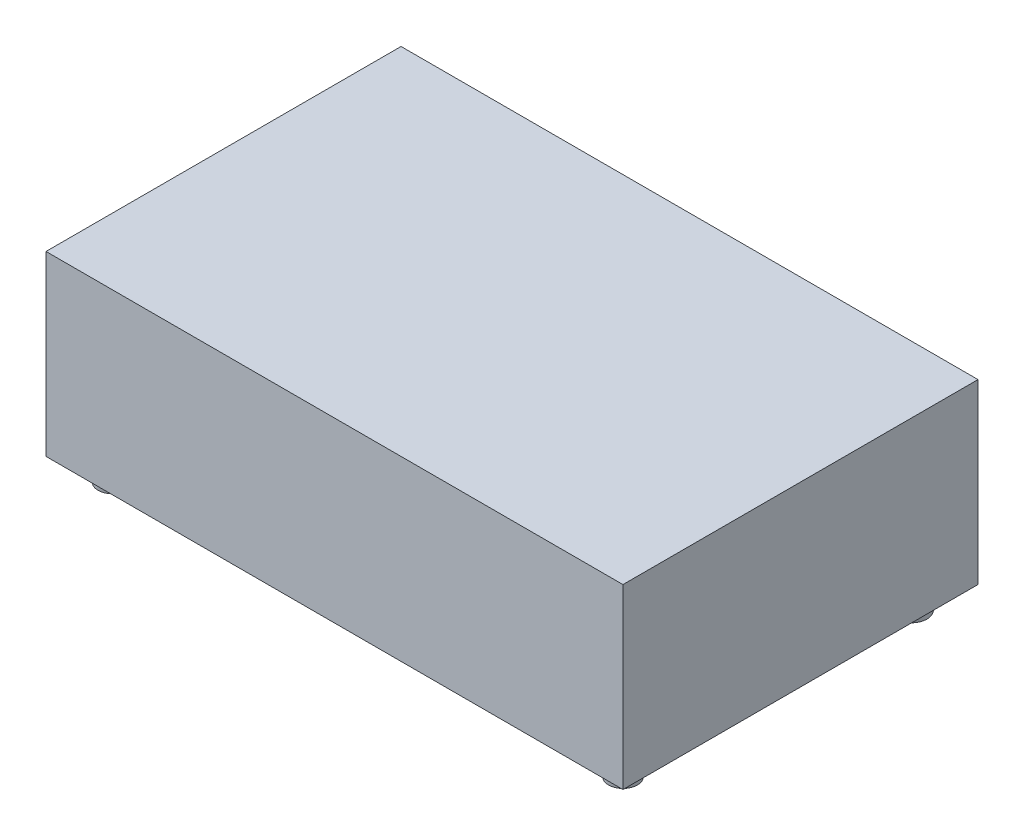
ISO-10303-21;
HEADER;
FILE_DESCRIPTION(('STEP AP214'),'2;1');
FILE_NAME('part.step','',(''),(''),'','','');
FILE_SCHEMA(('AUTOMOTIVE_DESIGN { 1 0 10303 214 1 1 1 1 }'));
ENDSEC;
DATA;
#1=APPLICATION_CONTEXT('core data for automotive mechanical design processes');
#2=APPLICATION_PROTOCOL_DEFINITION('international standard','automotive_design',2000,#1);
#3=PRODUCT_CONTEXT('',#1,'mechanical');
#4=PRODUCT('Part','Part','',(#3));
#5=PRODUCT_RELATED_PRODUCT_CATEGORY('part','',(#4));
#6=PRODUCT_DEFINITION_FORMATION('','',#4);
#7=PRODUCT_DEFINITION_CONTEXT('part definition',#1,'design');
#8=PRODUCT_DEFINITION('design','',#6,#7);
#9=PRODUCT_DEFINITION_SHAPE('','',#8);
#10=(LENGTH_UNIT() NAMED_UNIT(*) SI_UNIT(.MILLI.,.METRE.));
#11=(NAMED_UNIT(*) PLANE_ANGLE_UNIT() SI_UNIT($,.RADIAN.));
#12=(NAMED_UNIT(*) SI_UNIT($,.STERADIAN.) SOLID_ANGLE_UNIT());
#13=UNCERTAINTY_MEASURE_WITH_UNIT(LENGTH_MEASURE(1.E-05),#10,'distance_accuracy_value','');
#14=(GEOMETRIC_REPRESENTATION_CONTEXT(3) GLOBAL_UNCERTAINTY_ASSIGNED_CONTEXT((#13)) GLOBAL_UNIT_ASSIGNED_CONTEXT((#10,
#11,#12)) REPRESENTATION_CONTEXT('',''));
#15=CARTESIAN_POINT('',(0.,0.,0.));
#16=DIRECTION('',(0.,0.,1.));
#17=DIRECTION('',(1.,0.,0.));
#18=AXIS2_PLACEMENT_3D('',#15,#16,#17);
#19=CARTESIAN_POINT('',(0.,-80.,160.));
#20=DIRECTION('',(0.,1.,0.));
#21=DIRECTION('',(0.,0.,1.));
#22=AXIS2_PLACEMENT_3D('',#19,#20,#21);
#23=PLANE('',#22);
#24=CARTESIAN_POINT('',(15.,-80.,15.));
#25=DIRECTION('',(0.,1.,0.));
#26=DIRECTION('',(0.,0.,1.));
#27=AXIS2_PLACEMENT_3D('',#24,#25,#26);
#28=CIRCLE('',#27,8.);
#29=CARTESIAN_POINT('',(15.,-80.,23.));
#30=VERTEX_POINT('',#29);
#31=EDGE_CURVE('E116',#30,#30,#28,.F.);
#32=ORIENTED_EDGE('',*,*,#31,.F.);
#33=EDGE_LOOP('',(#32));
#34=FACE_BOUND('',#33,.T.);
#35=CARTESIAN_POINT('',(15.,-80.,145.));
#36=DIRECTION('',(0.,1.,0.));
#37=DIRECTION('',(0.,0.,1.));
#38=AXIS2_PLACEMENT_3D('',#35,#36,#37);
#39=CIRCLE('',#38,7.5);
#40=CARTESIAN_POINT('',(15.,-80.,152.5));
#41=VERTEX_POINT('',#40);
#42=EDGE_CURVE('E110',#41,#41,#39,.F.);
#43=ORIENTED_EDGE('',*,*,#42,.F.);
#44=EDGE_LOOP('',(#43));
#45=FACE_BOUND('',#44,.T.);
#46=DIRECTION('',(1.,0.,0.));
#47=VECTOR('',#46,1.);
#48=CARTESIAN_POINT('',(0.,-80.,0.));
#49=LINE('',#48,#47);
#50=CARTESIAN_POINT('',(0.,-80.,0.));
#51=VERTEX_POINT('',#50);
#52=CARTESIAN_POINT('',(260.,-80.,0.));
#53=VERTEX_POINT('',#52);
#54=EDGE_CURVE('E91',#51,#53,#49,.T.);
#55=ORIENTED_EDGE('',*,*,#54,.T.);
#56=DIRECTION('',(0.,0.,-1.));
#57=VECTOR('',#56,1.);
#58=CARTESIAN_POINT('',(260.,-80.,160.));
#59=LINE('',#58,#57);
#60=CARTESIAN_POINT('',(260.,-80.,160.));
#61=VERTEX_POINT('',#60);
#62=EDGE_CURVE('E89',#61,#53,#59,.T.);
#63=ORIENTED_EDGE('',*,*,#62,.F.);
#64=DIRECTION('',(1.,0.,0.));
#65=VECTOR('',#64,1.);
#66=CARTESIAN_POINT('',(0.,-80.,160.));
#67=LINE('',#66,#65);
#68=CARTESIAN_POINT('',(0.,-80.,160.));
#69=VERTEX_POINT('',#68);
#70=EDGE_CURVE('E81',#69,#61,#67,.T.);
#71=ORIENTED_EDGE('',*,*,#70,.F.);
#72=DIRECTION('',(0.,0.,-1.));
#73=VECTOR('',#72,1.);
#74=CARTESIAN_POINT('',(0.,-80.,160.));
#75=LINE('',#74,#73);
#76=EDGE_CURVE('E92',#69,#51,#75,.T.);
#77=ORIENTED_EDGE('',*,*,#76,.T.);
#78=EDGE_LOOP('',(#55,#63,#71,#77));
#79=FACE_BOUND('',#78,.T.);
#80=CARTESIAN_POINT('',(245.,-80.,145.));
#81=DIRECTION('',(0.,1.,0.));
#82=DIRECTION('',(0.,0.,1.));
#83=AXIS2_PLACEMENT_3D('',#80,#81,#82);
#84=CIRCLE('',#83,7.50000000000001);
#85=CARTESIAN_POINT('',(245.,-80.,152.5));
#86=VERTEX_POINT('',#85);
#87=EDGE_CURVE('E113',#86,#86,#84,.F.);
#88=ORIENTED_EDGE('',*,*,#87,.F.);
#89=EDGE_LOOP('',(#88));
#90=FACE_BOUND('',#89,.T.);
#91=CARTESIAN_POINT('',(245.,-80.,15.));
#92=DIRECTION('',(0.,1.,0.));
#93=DIRECTION('',(0.,0.,1.));
#94=AXIS2_PLACEMENT_3D('',#91,#92,#93);
#95=CIRCLE('',#94,7.99999999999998);
#96=CARTESIAN_POINT('',(245.,-80.,23.));
#97=VERTEX_POINT('',#96);
#98=EDGE_CURVE('E119',#97,#97,#95,.F.);
#99=ORIENTED_EDGE('',*,*,#98,.F.);
#100=EDGE_LOOP('',(#99));
#101=FACE_BOUND('',#100,.T.);
#102=ADVANCED_FACE('F33',(#34,#45,#79,#90,#101),#23,.F.);
#103=CARTESIAN_POINT('',(0.,0.,160.));
#104=DIRECTION('',(1.,0.,0.));
#105=DIRECTION('',(0.,1.,0.));
#106=AXIS2_PLACEMENT_3D('',#103,#104,#105);
#107=PLANE('',#106);
#108=DIRECTION('',(0.,-1.,0.));
#109=VECTOR('',#108,1.);
#110=CARTESIAN_POINT('',(0.,0.,0.));
#111=LINE('',#110,#109);
#112=CARTESIAN_POINT('',(0.,0.,0.));
#113=VERTEX_POINT('',#112);
#114=EDGE_CURVE('E101',#113,#51,#111,.T.);
#115=ORIENTED_EDGE('',*,*,#114,.T.);
#116=ORIENTED_EDGE('',*,*,#76,.F.);
#117=DIRECTION('',(0.,-1.,0.));
#118=VECTOR('',#117,1.);
#119=CARTESIAN_POINT('',(0.,0.,160.));
#120=LINE('',#119,#118);
#121=CARTESIAN_POINT('',(0.,0.,160.));
#122=VERTEX_POINT('',#121);
#123=EDGE_CURVE('E86',#122,#69,#120,.T.);
#124=ORIENTED_EDGE('',*,*,#123,.F.);
#125=DIRECTION('',(0.,0.,-1.));
#126=VECTOR('',#125,1.);
#127=CARTESIAN_POINT('',(0.,0.,160.));
#128=LINE('',#127,#126);
#129=EDGE_CURVE('E97',#122,#113,#128,.T.);
#130=ORIENTED_EDGE('',*,*,#129,.T.);
#131=EDGE_LOOP('',(#115,#116,#124,#130));
#132=FACE_BOUND('',#131,.T.);
#133=ADVANCED_FACE('F145',(#132),#107,.F.);
#134=CARTESIAN_POINT('',(260.,0.,160.));
#135=DIRECTION('',(-1.,0.,0.));
#136=DIRECTION('',(0.,0.,1.));
#137=AXIS2_PLACEMENT_3D('',#134,#135,#136);
#138=PLANE('',#137);
#139=DIRECTION('',(0.,1.,0.));
#140=VECTOR('',#139,1.);
#141=CARTESIAN_POINT('',(260.,0.,0.));
#142=LINE('',#141,#140);
#143=CARTESIAN_POINT('',(260.,0.,0.));
#144=VERTEX_POINT('',#143);
#145=EDGE_CURVE('E67',#53,#144,#142,.T.);
#146=ORIENTED_EDGE('',*,*,#145,.T.);
#147=DIRECTION('',(0.,0.,-1.));
#148=VECTOR('',#147,1.);
#149=CARTESIAN_POINT('',(260.,0.,160.));
#150=LINE('',#149,#148);
#151=CARTESIAN_POINT('',(260.,0.,160.));
#152=VERTEX_POINT('',#151);
#153=EDGE_CURVE('E93',#152,#144,#150,.T.);
#154=ORIENTED_EDGE('',*,*,#153,.F.);
#155=DIRECTION('',(0.,1.,0.));
#156=VECTOR('',#155,1.);
#157=CARTESIAN_POINT('',(260.,0.,160.));
#158=LINE('',#157,#156);
#159=EDGE_CURVE('E84',#61,#152,#158,.T.);
#160=ORIENTED_EDGE('',*,*,#159,.F.);
#161=ORIENTED_EDGE('',*,*,#62,.T.);
#162=EDGE_LOOP('',(#146,#154,#160,#161));
#163=FACE_BOUND('',#162,.T.);
#164=ADVANCED_FACE('F95',(#163),#138,.F.);
#165=CARTESIAN_POINT('',(0.,0.,160.));
#166=DIRECTION('',(0.,-1.,0.));
#167=DIRECTION('',(0.,0.,-1.));
#168=AXIS2_PLACEMENT_3D('',#165,#166,#167);
#169=PLANE('',#168);
#170=DIRECTION('',(-1.,0.,0.));
#171=VECTOR('',#170,1.);
#172=CARTESIAN_POINT('',(0.,0.,0.));
#173=LINE('',#172,#171);
#174=EDGE_CURVE('E73',#144,#113,#173,.T.);
#175=ORIENTED_EDGE('',*,*,#174,.T.);
#176=ORIENTED_EDGE('',*,*,#129,.F.);
#177=DIRECTION('',(-1.,0.,0.));
#178=VECTOR('',#177,1.);
#179=CARTESIAN_POINT('',(0.,0.,160.));
#180=LINE('',#179,#178);
#181=EDGE_CURVE('E50',#152,#122,#180,.T.);
#182=ORIENTED_EDGE('',*,*,#181,.F.);
#183=ORIENTED_EDGE('',*,*,#153,.T.);
#184=EDGE_LOOP('',(#175,#176,#182,#183));
#185=FACE_BOUND('',#184,.T.);
#186=ADVANCED_FACE('F184',(#185),#169,.F.);
#187=CARTESIAN_POINT('',(0.,-80.,160.));
#188=DIRECTION('',(0.,0.,1.));
#189=DIRECTION('',(1.,0.,0.));
#190=AXIS2_PLACEMENT_3D('',#187,#188,#189);
#191=PLANE('',#190);
#192=ORIENTED_EDGE('',*,*,#123,.T.);
#193=ORIENTED_EDGE('',*,*,#70,.T.);
#194=ORIENTED_EDGE('',*,*,#159,.T.);
#195=ORIENTED_EDGE('',*,*,#181,.T.);
#196=EDGE_LOOP('',(#192,#193,#194,#195));
#197=FACE_BOUND('',#196,.T.);
#198=ADVANCED_FACE('F82',(#197),#191,.T.);
#199=CARTESIAN_POINT('',(0.,-80.,0.));
#200=DIRECTION('',(0.,0.,1.));
#201=DIRECTION('',(1.,0.,0.));
#202=AXIS2_PLACEMENT_3D('',#199,#200,#201);
#203=PLANE('',#202);
#204=ORIENTED_EDGE('',*,*,#114,.F.);
#205=ORIENTED_EDGE('',*,*,#174,.F.);
#206=ORIENTED_EDGE('',*,*,#145,.F.);
#207=ORIENTED_EDGE('',*,*,#54,.F.);
#208=EDGE_LOOP('',(#204,#205,#206,#207));
#209=FACE_BOUND('',#208,.T.);
#210=ADVANCED_FACE('F180',(#209),#203,.F.);
#211=CARTESIAN_POINT('',(15.,-90.,145.));
#212=DIRECTION('',(0.,-1.,0.));
#213=DIRECTION('',(0.,0.,-1.));
#214=AXIS2_PLACEMENT_3D('',#211,#212,#213);
#215=PLANE('',#214);
#216=CARTESIAN_POINT('',(15.,-90.,145.));
#217=DIRECTION('',(0.,-1.,0.));
#218=DIRECTION('',(0.,0.,-1.));
#219=AXIS2_PLACEMENT_3D('',#216,#217,#218);
#220=CIRCLE('',#219,6.49999999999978);
#221=CARTESIAN_POINT('',(15.,-90.,151.5));
#222=VERTEX_POINT('',#221);
#223=EDGE_CURVE('E11',#222,#222,#220,.T.);
#224=ORIENTED_EDGE('',*,*,#223,.T.);
#225=EDGE_LOOP('',(#224));
#226=FACE_BOUND('',#225,.T.);
#227=ADVANCED_FACE('F175',(#226),#215,.T.);
#228=CARTESIAN_POINT('',(245.,-90.,145.));
#229=DIRECTION('',(0.,-1.,0.));
#230=DIRECTION('',(0.,0.,-1.));
#231=AXIS2_PLACEMENT_3D('',#228,#229,#230);
#232=PLANE('',#231);
#233=CARTESIAN_POINT('',(245.,-90.,145.));
#234=DIRECTION('',(0.,-1.,0.));
#235=DIRECTION('',(0.,0.,-1.));
#236=AXIS2_PLACEMENT_3D('',#233,#234,#235);
#237=CIRCLE('',#236,6.49999999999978);
#238=CARTESIAN_POINT('',(245.,-90.,138.5));
#239=VERTEX_POINT('',#238);
#240=EDGE_CURVE('E42',#239,#239,#237,.T.);
#241=ORIENTED_EDGE('',*,*,#240,.T.);
#242=EDGE_LOOP('',(#241));
#243=FACE_BOUND('',#242,.T.);
#244=ADVANCED_FACE('F130',(#243),#232,.T.);
#245=CARTESIAN_POINT('',(15.,-90.,15.));
#246=DIRECTION('',(0.,-1.,0.));
#247=DIRECTION('',(0.,0.,-1.));
#248=AXIS2_PLACEMENT_3D('',#245,#246,#247);
#249=PLANE('',#248);
#250=CARTESIAN_POINT('',(15.,-90.,15.));
#251=DIRECTION('',(0.,-1.,0.));
#252=DIRECTION('',(0.,0.,-1.));
#253=AXIS2_PLACEMENT_3D('',#250,#251,#252);
#254=CIRCLE('',#253,6.99999999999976);
#255=CARTESIAN_POINT('',(15.,-90.,8.00000000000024));
#256=VERTEX_POINT('',#255);
#257=EDGE_CURVE('E122',#256,#256,#254,.T.);
#258=ORIENTED_EDGE('',*,*,#257,.T.);
#259=EDGE_LOOP('',(#258));
#260=FACE_BOUND('',#259,.T.);
#261=ADVANCED_FACE('F164',(#260),#249,.T.);
#262=CARTESIAN_POINT('',(245.,-90.,15.));
#263=DIRECTION('',(0.,-1.,0.));
#264=DIRECTION('',(0.,0.,-1.));
#265=AXIS2_PLACEMENT_3D('',#262,#263,#264);
#266=PLANE('',#265);
#267=CARTESIAN_POINT('',(245.,-90.,15.));
#268=DIRECTION('',(0.,-1.,0.));
#269=DIRECTION('',(0.,0.,-1.));
#270=AXIS2_PLACEMENT_3D('',#267,#268,#269);
#271=CIRCLE('',#270,6.99999999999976);
#272=CARTESIAN_POINT('',(245.,-90.,8.00000000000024));
#273=VERTEX_POINT('',#272);
#274=EDGE_CURVE('E125',#273,#273,#271,.T.);
#275=ORIENTED_EDGE('',*,*,#274,.T.);
#276=EDGE_LOOP('',(#275));
#277=FACE_BOUND('',#276,.T.);
#278=ADVANCED_FACE('F159',(#277),#266,.T.);
#279=CARTESIAN_POINT('',(15.,-90.,15.));
#280=DIRECTION('',(0.,1.,0.));
#281=DIRECTION('',(0.,0.,1.));
#282=AXIS2_PLACEMENT_3D('',#279,#280,#281);
#283=CONICAL_SURFACE('',#282,6.99999999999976,0.0996686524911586);
#284=ORIENTED_EDGE('',*,*,#31,.T.);
#285=EDGE_LOOP('',(#284));
#286=FACE_BOUND('',#285,.T.);
#287=ORIENTED_EDGE('',*,*,#257,.F.);
#288=EDGE_LOOP('',(#287));
#289=FACE_BOUND('',#288,.T.);
#290=ADVANCED_FACE('F141',(#286,#289),#283,.T.);
#291=CARTESIAN_POINT('',(245.,-90.,15.));
#292=DIRECTION('',(0.,1.,0.));
#293=DIRECTION('',(0.,0.,1.));
#294=AXIS2_PLACEMENT_3D('',#291,#292,#293);
#295=CONICAL_SURFACE('',#294,6.99999999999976,0.0996686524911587);
#296=ORIENTED_EDGE('',*,*,#98,.T.);
#297=EDGE_LOOP('',(#296));
#298=FACE_BOUND('',#297,.T.);
#299=ORIENTED_EDGE('',*,*,#274,.F.);
#300=EDGE_LOOP('',(#299));
#301=FACE_BOUND('',#300,.T.);
#302=ADVANCED_FACE('F134',(#298,#301),#295,.T.);
#303=CARTESIAN_POINT('',(245.,-90.,145.));
#304=DIRECTION('',(0.,1.,0.));
#305=DIRECTION('',(0.,0.,1.));
#306=AXIS2_PLACEMENT_3D('',#303,#304,#305);
#307=CONICAL_SURFACE('',#306,6.49999999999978,0.0996686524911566);
#308=ORIENTED_EDGE('',*,*,#87,.T.);
#309=EDGE_LOOP('',(#308));
#310=FACE_BOUND('',#309,.T.);
#311=ORIENTED_EDGE('',*,*,#240,.F.);
#312=EDGE_LOOP('',(#311));
#313=FACE_BOUND('',#312,.T.);
#314=ADVANCED_FACE('F132',(#310,#313),#307,.T.);
#315=CARTESIAN_POINT('',(15.,-90.,145.));
#316=DIRECTION('',(0.,1.,0.));
#317=DIRECTION('',(0.,0.,1.));
#318=AXIS2_PLACEMENT_3D('',#315,#316,#317);
#319=CONICAL_SURFACE('',#318,6.49999999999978,0.0996686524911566);
#320=CARTESIAN_POINT('',(15.,-80.,152.5));
#321=CARTESIAN_POINT('',(15.,-80.1041666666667,152.489583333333));
#322=CARTESIAN_POINT('',(15.,-80.2083333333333,152.479166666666));
#323=CARTESIAN_POINT('',(15.,-80.4166666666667,152.458333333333));
#324=CARTESIAN_POINT('',(15.,-80.5208333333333,152.447916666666));
#325=CARTESIAN_POINT('',(15.,-80.7291666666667,152.427083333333));
#326=CARTESIAN_POINT('',(15.,-80.8333333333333,152.416666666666));
#327=CARTESIAN_POINT('',(15.,-81.0416666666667,152.395833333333));
#328=CARTESIAN_POINT('',(15.,-81.1458333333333,152.385416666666));
#329=CARTESIAN_POINT('',(15.,-81.3541666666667,152.364583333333));
#330=CARTESIAN_POINT('',(15.,-81.4583333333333,152.354166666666));
#331=CARTESIAN_POINT('',(15.,-81.6666666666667,152.333333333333));
#332=CARTESIAN_POINT('',(15.,-81.7708333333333,152.322916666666));
#333=CARTESIAN_POINT('',(15.,-81.9791666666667,152.302083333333));
#334=CARTESIAN_POINT('',(15.,-82.0833333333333,152.291666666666));
#335=CARTESIAN_POINT('',(15.,-82.2916666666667,152.270833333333));
#336=CARTESIAN_POINT('',(15.,-82.3958333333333,152.260416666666));
#337=CARTESIAN_POINT('',(15.,-82.6041666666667,152.239583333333));
#338=CARTESIAN_POINT('',(15.,-82.7083333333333,152.229166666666));
#339=CARTESIAN_POINT('',(15.,-82.9166666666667,152.208333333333));
#340=CARTESIAN_POINT('',(15.,-83.0208333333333,152.197916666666));
#341=CARTESIAN_POINT('',(15.,-83.2291666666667,152.177083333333));
#342=CARTESIAN_POINT('',(15.,-83.3333333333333,152.166666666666));
#343=CARTESIAN_POINT('',(15.,-83.5416666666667,152.145833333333));
#344=CARTESIAN_POINT('',(15.,-83.6458333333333,152.135416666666));
#345=CARTESIAN_POINT('',(15.,-83.8541666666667,152.114583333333));
#346=CARTESIAN_POINT('',(15.,-83.9583333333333,152.104166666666));
#347=CARTESIAN_POINT('',(15.,-84.1666666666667,152.083333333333));
#348=CARTESIAN_POINT('',(15.,-84.2708333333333,152.072916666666));
#349=CARTESIAN_POINT('',(15.,-84.4791666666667,152.052083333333));
#350=CARTESIAN_POINT('',(15.,-84.5833333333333,152.041666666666));
#351=CARTESIAN_POINT('',(15.,-84.7916666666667,152.020833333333));
#352=CARTESIAN_POINT('',(15.,-84.8958333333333,152.010416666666));
#353=CARTESIAN_POINT('',(15.,-85.1041666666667,151.989583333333));
#354=CARTESIAN_POINT('',(15.,-85.2083333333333,151.979166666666));
#355=CARTESIAN_POINT('',(15.,-85.4166666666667,151.958333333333));
#356=CARTESIAN_POINT('',(15.,-85.5208333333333,151.947916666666));
#357=CARTESIAN_POINT('',(15.,-85.7291666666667,151.927083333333));
#358=CARTESIAN_POINT('',(15.,-85.8333333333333,151.916666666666));
#359=CARTESIAN_POINT('',(15.,-86.0416666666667,151.895833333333));
#360=CARTESIAN_POINT('',(15.,-86.1458333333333,151.885416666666));
#361=CARTESIAN_POINT('',(15.,-86.3541666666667,151.864583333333));
#362=CARTESIAN_POINT('',(15.,-86.4583333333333,151.854166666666));
#363=CARTESIAN_POINT('',(15.,-86.6666666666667,151.833333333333));
#364=CARTESIAN_POINT('',(15.,-86.7708333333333,151.822916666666));
#365=CARTESIAN_POINT('',(15.,-86.9791666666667,151.802083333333));
#366=CARTESIAN_POINT('',(15.,-87.0833333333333,151.791666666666));
#367=CARTESIAN_POINT('',(15.,-87.2916666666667,151.770833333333));
#368=CARTESIAN_POINT('',(15.,-87.3958333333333,151.760416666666));
#369=CARTESIAN_POINT('',(15.,-87.6041666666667,151.739583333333));
#370=CARTESIAN_POINT('',(15.,-87.7083333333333,151.729166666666));
#371=CARTESIAN_POINT('',(15.,-87.9166666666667,151.708333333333));
#372=CARTESIAN_POINT('',(15.,-88.0208333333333,151.697916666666));
#373=CARTESIAN_POINT('',(15.,-88.2291666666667,151.677083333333));
#374=CARTESIAN_POINT('',(15.,-88.3333333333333,151.666666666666));
#375=CARTESIAN_POINT('',(15.,-88.5416666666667,151.645833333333));
#376=CARTESIAN_POINT('',(15.,-88.6458333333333,151.635416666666));
#377=CARTESIAN_POINT('',(15.,-88.8541666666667,151.614583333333));
#378=CARTESIAN_POINT('',(15.,-88.9583333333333,151.604166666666));
#379=CARTESIAN_POINT('',(15.,-89.1666666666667,151.583333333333));
#380=CARTESIAN_POINT('',(15.,-89.2708333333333,151.572916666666));
#381=CARTESIAN_POINT('',(15.,-89.4791666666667,151.552083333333));
#382=CARTESIAN_POINT('',(15.,-89.5833333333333,151.541666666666));
#383=CARTESIAN_POINT('',(15.,-89.7916666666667,151.520833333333));
#384=CARTESIAN_POINT('',(15.,-89.8958333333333,151.510416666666));
#385=CARTESIAN_POINT('',(15.,-90.,151.5));
#386=B_SPLINE_CURVE_WITH_KNOTS('',3,(#320,#321,#322,#323,#324,#325,#326,#327,#328,#329,#330,
#331,#332,#333,#334,#335,#336,#337,#338,#339,#340,#341,#342,#343,#344,#345,#346,#347,#348,#349,
#350,#351,#352,#353,#354,#355,#356,#357,#358,#359,#360,#361,#362,#363,#364,#365,#366,#367,#368,
#369,#370,#371,#372,#373,#374,#375,#376,#377,#378,#379,#380,#381,#382,#383,#384,#385),
.UNSPECIFIED.,.F.,.F.,(4,2,2,2,2,2,2,2,2,2,2,2,2,2,2,2,2,2,2,2,2,2,2,2,2,2,2,2,2,2,2,2,4),(0.,
0.314058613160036,0.628117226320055,0.942175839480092,1.25623445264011,1.57029306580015,
1.88435167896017,2.19841029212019,2.51246890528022,2.82652751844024,3.14058613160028,
3.4546447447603,3.76870335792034,4.08276197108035,4.39682058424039,4.71087919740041,
5.02493781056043,5.33899642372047,5.65305503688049,5.96711365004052,6.28117226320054,
6.59523087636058,6.9092894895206,7.22334810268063,7.53740671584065,7.85146532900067,
8.16552394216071,8.47958255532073,8.79364116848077,9.10769978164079,9.42175839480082,
9.73581700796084,10.0498756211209),.UNSPECIFIED.);
#387=EDGE_CURVE('BSEAM35',#41,#222,#386,.T.);
#388=ORIENTED_EDGE('',*,*,#42,.T.);
#389=ORIENTED_EDGE('',*,*,#223,.F.);
#390=ORIENTED_EDGE('',*,*,#387,.T.);
#391=ORIENTED_EDGE('',*,*,#387,.F.);
#392=EDGE_LOOP('',(#388,#390,#389,#391));
#393=FACE_BOUND('',#392,.T.);
#394=ADVANCED_FACE('F35',(#393),#319,.T.);
#395=CLOSED_SHELL('',(#102,#133,#164,#186,#198,#210,#227,#244,#261,#278,#290,#302,#314,#394));
#396=MANIFOLD_SOLID_BREP('B2',#395);
#397=ADVANCED_BREP_SHAPE_REPRESENTATION('',(#18,#396),#14);
#398=SHAPE_DEFINITION_REPRESENTATION(#9,#397);
ENDSEC;
END-ISO-10303-21;
